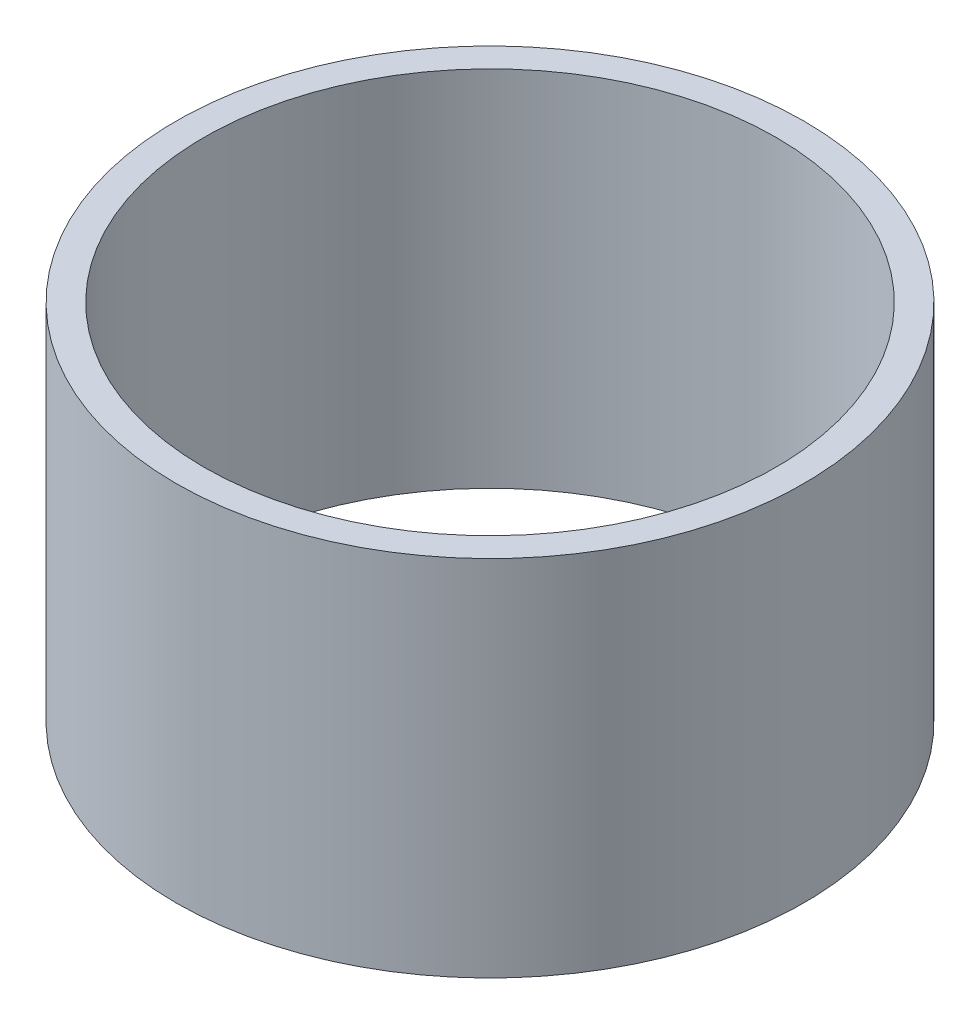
ISO-10303-21;
HEADER;
FILE_DESCRIPTION(('STEP AP214'),'2;1');
FILE_NAME('part.step','',(''),(''),'','','');
FILE_SCHEMA(('AUTOMOTIVE_DESIGN { 1 0 10303 214 1 1 1 1 }'));
ENDSEC;
DATA;
#1=APPLICATION_CONTEXT('core data for automotive mechanical design processes');
#2=APPLICATION_PROTOCOL_DEFINITION('international standard','automotive_design',2000,#1);
#3=PRODUCT_CONTEXT('',#1,'mechanical');
#4=PRODUCT('Part','Part','',(#3));
#5=PRODUCT_RELATED_PRODUCT_CATEGORY('part','',(#4));
#6=PRODUCT_DEFINITION_FORMATION('','',#4);
#7=PRODUCT_DEFINITION_CONTEXT('part definition',#1,'design');
#8=PRODUCT_DEFINITION('design','',#6,#7);
#9=PRODUCT_DEFINITION_SHAPE('','',#8);
#10=(LENGTH_UNIT() NAMED_UNIT(*) SI_UNIT(.MILLI.,.METRE.));
#11=(NAMED_UNIT(*) PLANE_ANGLE_UNIT() SI_UNIT($,.RADIAN.));
#12=(NAMED_UNIT(*) SI_UNIT($,.STERADIAN.) SOLID_ANGLE_UNIT());
#13=UNCERTAINTY_MEASURE_WITH_UNIT(LENGTH_MEASURE(1.E-05),#10,'distance_accuracy_value','');
#14=(GEOMETRIC_REPRESENTATION_CONTEXT(3) GLOBAL_UNCERTAINTY_ASSIGNED_CONTEXT((#13)) GLOBAL_UNIT_ASSIGNED_CONTEXT((#10,
#11,#12)) REPRESENTATION_CONTEXT('',''));
#15=CARTESIAN_POINT('',(0.,0.,0.));
#16=DIRECTION('',(0.,0.,1.));
#17=DIRECTION('',(1.,0.,0.));
#18=AXIS2_PLACEMENT_3D('',#15,#16,#17);
#19=CARTESIAN_POINT('',(0.,16.2,0.));
#20=DIRECTION('',(0.,1.,0.));
#21=DIRECTION('',(0.,0.,1.));
#22=AXIS2_PLACEMENT_3D('',#19,#20,#21);
#23=PLANE('',#22);
#24=CARTESIAN_POINT('',(0.,16.2,0.));
#25=DIRECTION('',(0.,1.,0.));
#26=DIRECTION('',(0.,0.,1.));
#27=AXIS2_PLACEMENT_3D('',#24,#25,#26);
#28=CIRCLE('',#27,14.);
#29=CARTESIAN_POINT('',(0.,16.2,14.));
#30=VERTEX_POINT('',#29);
#31=EDGE_CURVE('E10',#30,#30,#28,.T.);
#32=ORIENTED_EDGE('',*,*,#31,.T.);
#33=EDGE_LOOP('',(#32));
#34=FACE_BOUND('',#33,.T.);
#35=CARTESIAN_POINT('',(0.,16.2,0.));
#36=DIRECTION('',(0.,1.,0.));
#37=DIRECTION('',(0.,0.,1.));
#38=AXIS2_PLACEMENT_3D('',#35,#36,#37);
#39=CIRCLE('',#38,12.75);
#40=CARTESIAN_POINT('',(0.,16.2,12.75));
#41=VERTEX_POINT('',#40);
#42=EDGE_CURVE('E43',#41,#41,#39,.T.);
#43=ORIENTED_EDGE('',*,*,#42,.F.);
#44=EDGE_LOOP('',(#43));
#45=FACE_BOUND('',#44,.T.);
#46=ADVANCED_FACE('F32',(#34,#45),#23,.T.);
#47=CARTESIAN_POINT('',(0.,0.,0.));
#48=DIRECTION('',(0.,1.,0.));
#49=DIRECTION('',(0.,0.,1.));
#50=AXIS2_PLACEMENT_3D('',#47,#48,#49);
#51=PLANE('',#50);
#52=CARTESIAN_POINT('',(0.,0.,0.));
#53=DIRECTION('',(0.,1.,0.));
#54=DIRECTION('',(0.,0.,1.));
#55=AXIS2_PLACEMENT_3D('',#52,#53,#54);
#56=CIRCLE('',#55,14.);
#57=CARTESIAN_POINT('',(0.,0.,14.));
#58=VERTEX_POINT('',#57);
#59=EDGE_CURVE('E36',#58,#58,#56,.T.);
#60=ORIENTED_EDGE('',*,*,#59,.F.);
#61=EDGE_LOOP('',(#60));
#62=FACE_BOUND('',#61,.T.);
#63=CARTESIAN_POINT('',(0.,0.,0.));
#64=DIRECTION('',(0.,1.,0.));
#65=DIRECTION('',(0.,0.,1.));
#66=AXIS2_PLACEMENT_3D('',#63,#64,#65);
#67=CIRCLE('',#66,12.75);
#68=CARTESIAN_POINT('',(0.,0.,12.75));
#69=VERTEX_POINT('',#68);
#70=EDGE_CURVE('E45',#69,#69,#67,.T.);
#71=ORIENTED_EDGE('',*,*,#70,.T.);
#72=EDGE_LOOP('',(#71));
#73=FACE_BOUND('',#72,.T.);
#74=ADVANCED_FACE('F55',(#62,#73),#51,.F.);
#75=CARTESIAN_POINT('',(0.,16.2,0.));
#76=DIRECTION('',(0.,-1.,0.));
#77=DIRECTION('',(0.,0.,-1.));
#78=AXIS2_PLACEMENT_3D('',#75,#76,#77);
#79=CYLINDRICAL_SURFACE('',#78,14.);
#80=ORIENTED_EDGE('',*,*,#31,.F.);
#81=EDGE_LOOP('',(#80));
#82=FACE_BOUND('',#81,.T.);
#83=ORIENTED_EDGE('',*,*,#59,.T.);
#84=EDGE_LOOP('',(#83));
#85=FACE_BOUND('',#84,.T.);
#86=ADVANCED_FACE('F34',(#82,#85),#79,.T.);
#87=CARTESIAN_POINT('',(0.,16.2,0.));
#88=DIRECTION('',(0.,-1.,0.));
#89=DIRECTION('',(0.,0.,-1.));
#90=AXIS2_PLACEMENT_3D('',#87,#88,#89);
#91=CYLINDRICAL_SURFACE('',#90,12.75);
#92=ORIENTED_EDGE('',*,*,#42,.T.);
#93=EDGE_LOOP('',(#92));
#94=FACE_BOUND('',#93,.T.);
#95=ORIENTED_EDGE('',*,*,#70,.F.);
#96=EDGE_LOOP('',(#95));
#97=FACE_BOUND('',#96,.T.);
#98=ADVANCED_FACE('F51',(#94,#97),#91,.F.);
#99=CLOSED_SHELL('',(#46,#74,#86,#98));
#100=MANIFOLD_SOLID_BREP('B2',#99);
#101=ADVANCED_BREP_SHAPE_REPRESENTATION('',(#18,#100),#14);
#102=SHAPE_DEFINITION_REPRESENTATION(#9,#101);
ENDSEC;
END-ISO-10303-21;
